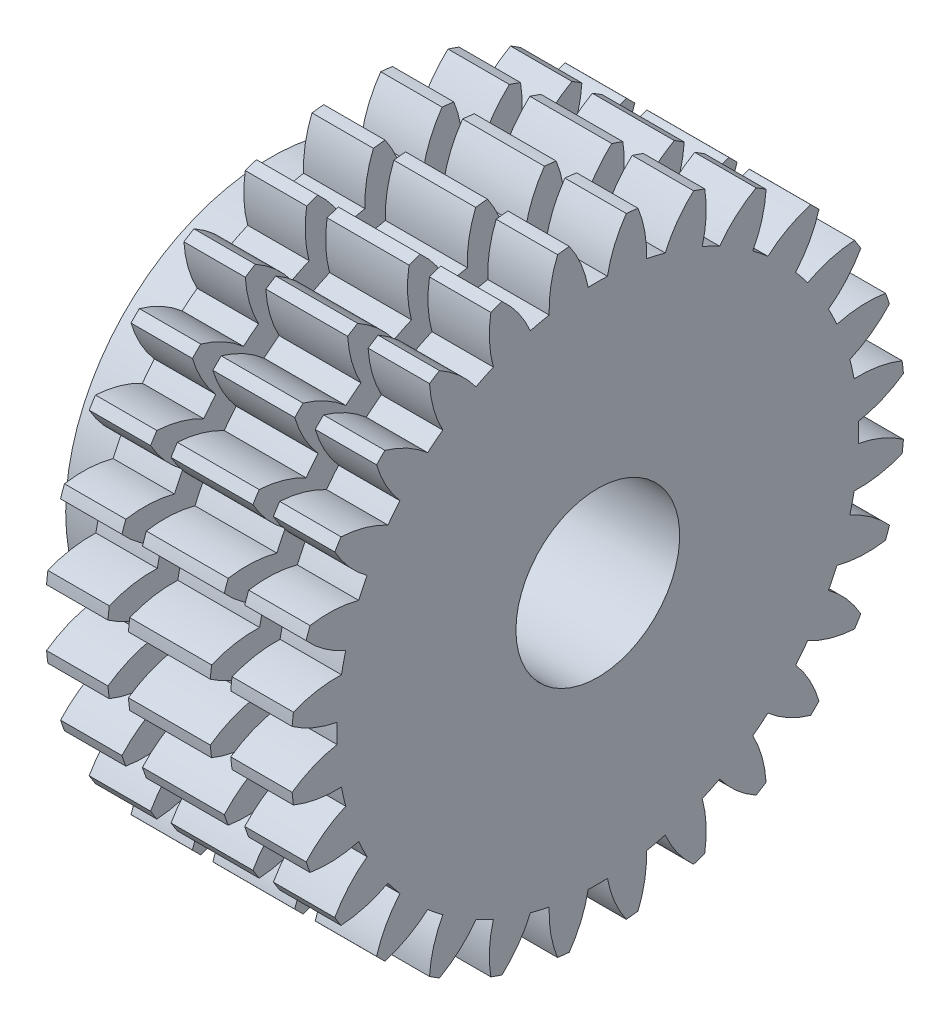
from build123d import *

# Parameters (mm, degrees)
BASPROSKE_W                = 6
BASPROSKE_H                = 7.5
TOOTHCUT_DEPTH             = 13.186057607
TEETHCUTS_COUNT            = 28
TEETHCUTS_ANGLE            = 347.142857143
HUBNEAONESKE_R             = 5
HUBNEARONE_DEPTH           = 2.0000508
BORSKE_R                   = 2
BORE_DEPTH                 = 8.0000508
ESQUISSE1_R                = 8
ESQUISSE1_R_2              = 5
ENL_V_MAT_EXTRU_1_DEPTH    = 0.5
R_P_TITION_LIN_AIRE1_COUNT = 2
R_P_TITION_LIN_AIRE1_PITCH = 2.5


with BuildPart() as part:
    # BasProSke → Base-Revolve (revolve)
    with BuildSketch(Plane(origin=(0, 0, 0), x_dir=(1, 0, 0), z_dir=(0, 1, 0)), mode=Mode.PRIVATE) as base_revolve_sk:
        with Locations((3, 3.75)):
            Rectangle(BASPROSKE_W, BASPROSKE_H)
    revolve(base_revolve_sk.sketch.rotate(Axis((-10, 0, 0), (1, 0, 0)), 180), axis=Axis((-10, 0, 0), (1, 0, 0)))

    # TooCutSke → ToothCut (cut, through all)
    with BuildSketch(Plane(origin=(0, 0, 0), x_dir=(0, 0, -1), z_dir=(1, 0, 0))):
        with BuildLine():
            ThreePointArc((0.235575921, 6.369645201), (0, 6.374), (-0.235575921, 6.369645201))
            ThreePointArc((-0.235575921, 6.369645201), (-0.412688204, 6.956904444), (-0.713425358, 7.491506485))
            ThreePointArc((-0.713425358, 7.491506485), (0, 7.5254), (0.713425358, 7.491506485))
            ThreePointArc((0.713425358, 7.491506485), (0.412688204, 6.956904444), (0.235575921, 6.369645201))
        make_face()
    toothcut = extrude(amount=TOOTHCUT_DEPTH, mode=Mode.SUBTRACT)

    # TeethCuts: ToothCut ×28 about axis
    teethcuts_axis = Axis((-10, 0, 0), (1, 0, 0))
    for i in range(1, TEETHCUTS_COUNT):
        add(toothcut.rotate(teethcuts_axis, i * TEETHCUTS_ANGLE / (TEETHCUTS_COUNT - 1)), mode=Mode.SUBTRACT)

    # HubNeaOneSke → HubNearOne (add)
    with BuildSketch(Plane.ZY):
        with Locations(Location((0, 0, 0), (0, 0, 180))):
            Circle(HUBNEAONESKE_R)
    extrude(amount=HUBNEARONE_DEPTH)

    # BorSke → Bore (cut, symmetric)
    with BuildSketch(Plane(origin=(0, 0, 0), x_dir=(0, 0, -1), z_dir=(1, 0, 0))):
        with Locations(Location((0, 0, 0), (0, 0, 180))):
            Circle(BORSKE_R)
    extrude(amount=BORE_DEPTH, both=True, mode=Mode.SUBTRACT)

    # Esquisse1 → Enl_v. mat.-Extru.1 (cut)
    with BuildSketch(Plane(origin=(4.5, 0, 0), x_dir=(0, 0, -1), z_dir=(1, 0, 0))):
        Circle(ESQUISSE1_R)
        Circle(ESQUISSE1_R_2, mode=Mode.SUBTRACT)
    enl_v_mat_extru_1 = extrude(amount=-ENL_V_MAT_EXTRU_1_DEPTH, mode=Mode.SUBTRACT)

    # R_p_tition lin_aire1: Enl_v. mat.-Extru.1 ×2
    with Locations(*[(-i * R_P_TITION_LIN_AIRE1_PITCH, 0, 0) for i in range(1, R_P_TITION_LIN_AIRE1_COUNT)]):
        add(enl_v_mat_extru_1, mode=Mode.SUBTRACT)


solid = part.part
